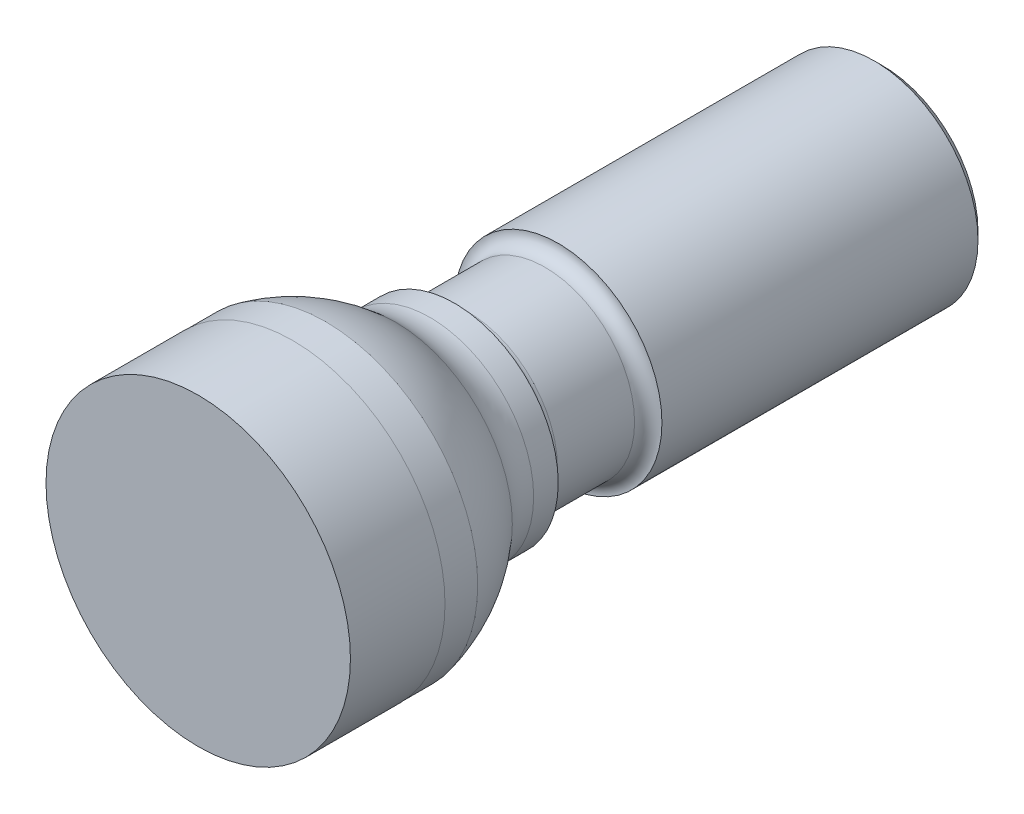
ISO-10303-21;
HEADER;
FILE_DESCRIPTION(('STEP AP214'),'2;1');
FILE_NAME('part.step','',(''),(''),'','','');
FILE_SCHEMA(('AUTOMOTIVE_DESIGN { 1 0 10303 214 1 1 1 1 }'));
ENDSEC;
DATA;
#1=APPLICATION_CONTEXT('core data for automotive mechanical design processes');
#2=APPLICATION_PROTOCOL_DEFINITION('international standard','automotive_design',2000,#1);
#3=PRODUCT_CONTEXT('',#1,'mechanical');
#4=PRODUCT('Part','Part','',(#3));
#5=PRODUCT_RELATED_PRODUCT_CATEGORY('part','',(#4));
#6=PRODUCT_DEFINITION_FORMATION('','',#4);
#7=PRODUCT_DEFINITION_CONTEXT('part definition',#1,'design');
#8=PRODUCT_DEFINITION('design','',#6,#7);
#9=PRODUCT_DEFINITION_SHAPE('','',#8);
#10=(LENGTH_UNIT() NAMED_UNIT(*) SI_UNIT(.MILLI.,.METRE.));
#11=(NAMED_UNIT(*) PLANE_ANGLE_UNIT() SI_UNIT($,.RADIAN.));
#12=(NAMED_UNIT(*) SI_UNIT($,.STERADIAN.) SOLID_ANGLE_UNIT());
#13=UNCERTAINTY_MEASURE_WITH_UNIT(LENGTH_MEASURE(1.E-05),#10,'distance_accuracy_value','');
#14=(GEOMETRIC_REPRESENTATION_CONTEXT(3) GLOBAL_UNCERTAINTY_ASSIGNED_CONTEXT((#13)) GLOBAL_UNIT_ASSIGNED_CONTEXT((#10,
#11,#12)) REPRESENTATION_CONTEXT('',''));
#15=CARTESIAN_POINT('',(0.,0.,0.));
#16=DIRECTION('',(0.,0.,1.));
#17=DIRECTION('',(1.,0.,0.));
#18=AXIS2_PLACEMENT_3D('',#15,#16,#17);
#19=CARTESIAN_POINT('',(0.,3.10340819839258E-13,-5.79120000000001));
#20=DIRECTION('',(0.,0.,1.));
#21=DIRECTION('',(0.,1.,0.));
#22=AXIS2_PLACEMENT_3D('',#19,#20,#21);
#23=SPHERICAL_SURFACE('',#22,9.52499999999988);
#24=CARTESIAN_POINT('',(0.,0.,-7.80770246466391));
#25=DIRECTION('',(0.,0.,1.));
#26=DIRECTION('',(1.,0.,0.));
#27=AXIS2_PLACEMENT_3D('',#24,#25,#26);
#28=CIRCLE('',#27,9.30910000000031);
#29=CARTESIAN_POINT('',(0.,9.30910000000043,-7.80770246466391));
#30=VERTEX_POINT('',#29);
#31=EDGE_CURVE('E192',#30,#30,#28,.T.);
#32=CARTESIAN_POINT('',(0.,0.,-12.0913953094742));
#33=DIRECTION('',(0.,0.,1.));
#34=DIRECTION('',(1.,0.,0.));
#35=AXIS2_PLACEMENT_3D('',#32,#33,#34);
#36=CIRCLE('',#35,7.14374999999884);
#37=CARTESIAN_POINT('',(0.,7.14374999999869,-12.0913953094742));
#38=VERTEX_POINT('',#37);
#39=EDGE_CURVE('E145',#38,#38,#36,.T.);
#40=CARTESIAN_POINT('',(0.,9.30910000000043,-7.80770246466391));
#41=CARTESIAN_POINT('',(0.,9.29839968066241,-7.85710021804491));
#42=CARTESIAN_POINT('',(0.,9.28730610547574,-7.90641278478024));
#43=CARTESIAN_POINT('',(0.,9.26433541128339,-8.00485508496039));
#44=CARTESIAN_POINT('',(0.,9.2524582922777,-8.05398481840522));
#45=CARTESIAN_POINT('',(0.,9.22792347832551,-8.15204899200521));
#46=CARTESIAN_POINT('',(0.,9.21526578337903,-8.20098343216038));
#47=CARTESIAN_POINT('',(0.,9.18917303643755,-8.29864462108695));
#48=CARTESIAN_POINT('',(0.,9.17573798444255,-8.34737136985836));
#49=CARTESIAN_POINT('',(0.,9.14809392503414,-8.44460482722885));
#50=CARTESIAN_POINT('',(0.,9.13388491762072,-8.49311153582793));
#51=CARTESIAN_POINT('',(0.,9.10469654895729,-8.58989262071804));
#52=CARTESIAN_POINT('',(0.,9.08971718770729,-8.63816699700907));
#53=CARTESIAN_POINT('',(0.,9.05899190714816,-8.73447118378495));
#54=CARTESIAN_POINT('',(0.,9.04324598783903,-8.78250099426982));
#55=CARTESIAN_POINT('',(0.,9.01099158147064,-8.8783038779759));
#56=CARTESIAN_POINT('',(0.,8.99448309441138,-8.92607695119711));
#57=CARTESIAN_POINT('',(0.,8.96070773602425,-9.02135425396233));
#58=CARTESIAN_POINT('',(0.,8.94344086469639,-9.06885848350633));
#59=CARTESIAN_POINT('',(0.,8.9081531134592,-9.16358606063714));
#60=CARTESIAN_POINT('',(0.,8.89013223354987,-9.21080940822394));
#61=CARTESIAN_POINT('',(0.,8.85334103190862,-9.30496325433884));
#62=CARTESIAN_POINT('',(0.,8.83457071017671,-9.35189375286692));
#63=CARTESIAN_POINT('',(0.,8.79628538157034,-9.4454500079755));
#64=CARTESIAN_POINT('',(0.,8.77677037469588,-9.49207576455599));
#65=CARTESIAN_POINT('',(0.,8.73700062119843,-9.58501072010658));
#66=CARTESIAN_POINT('',(0.,8.71674587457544,-9.63131991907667));
#67=CARTESIAN_POINT('',(0.,8.6755017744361,-9.72361002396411));
#68=CARTESIAN_POINT('',(0.,8.65451242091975,-9.76959092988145));
#69=CARTESIAN_POINT('',(0.,8.61180442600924,-9.86121279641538));
#70=CARTESIAN_POINT('',(0.,8.59008578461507,-9.90685375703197));
#71=CARTESIAN_POINT('',(0.,8.54592471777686,-9.9977841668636));
#72=CARTESIAN_POINT('',(0.,8.52348229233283,-10.0430736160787));
#73=CARTESIAN_POINT('',(0.,8.47787934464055,-10.1332895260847));
#74=CARTESIAN_POINT('',(0.,8.45471882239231,-10.1782159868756));
#75=CARTESIAN_POINT('',(0.,8.40768555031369,-10.2676945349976));
#76=CARTESIAN_POINT('',(0.,8.38381280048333,-10.3122466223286));
#77=CARTESIAN_POINT('',(0.,8.33536112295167,-10.4009651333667));
#78=CARTESIAN_POINT('',(0.,8.31078219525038,-10.4451315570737));
#79=CARTESIAN_POINT('',(0.,8.2609243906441,-10.5330675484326));
#80=CARTESIAN_POINT('',(0.,8.23564551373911,-10.5768371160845));
#81=CARTESIAN_POINT('',(0.,8.1843942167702,-10.6639683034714));
#82=CARTESIAN_POINT('',(0.,8.15842179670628,-10.7073299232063));
#83=CARTESIAN_POINT('',(0.,8.10578999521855,-10.7936342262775));
#84=CARTESIAN_POINT('',(0.,8.07913061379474,-10.8365769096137));
#85=CARTESIAN_POINT('',(0.,8.02513164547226,-10.9220324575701));
#86=CARTESIAN_POINT('',(0.,7.99779205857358,-10.9645453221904));
#87=CARTESIAN_POINT('',(0.,7.94243960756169,-11.0491304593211));
#88=CARTESIAN_POINT('',(0.,7.91442674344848,-11.0912027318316));
#89=CARTESIAN_POINT('',(0.,7.85773483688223,-11.1748960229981));
#90=CARTESIAN_POINT('',(0.,7.8290557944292,-11.2165170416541));
#91=CARTESIAN_POINT('',(0.,7.77103879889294,-11.2992972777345));
#92=CARTESIAN_POINT('',(0.,7.74170084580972,-11.3404564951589));
#93=CARTESIAN_POINT('',(0.,7.68237346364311,-11.4223026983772));
#94=CARTESIAN_POINT('',(0.,7.65238403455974,-11.4629896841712));
#95=CARTESIAN_POINT('',(0.,7.59176130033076,-11.5438811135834));
#96=CARTESIAN_POINT('',(0.,7.56112799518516,-11.5840855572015));
#97=CARTESIAN_POINT('',(0.,7.49922527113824,-11.6640017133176));
#98=CARTESIAN_POINT('',(0.,7.46795585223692,-11.7037134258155));
#99=CARTESIAN_POINT('',(0.,7.4047888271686,-11.7826340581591));
#100=CARTESIAN_POINT('',(0.,7.3728912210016,-11.8218429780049));
#101=CARTESIAN_POINT('',(0.,7.30847589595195,-11.899748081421));
#102=CARTESIAN_POINT('',(0.,7.2759581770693,-11.9384442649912));
#103=CARTESIAN_POINT('',(0.,7.21031089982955,-12.0153141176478));
#104=CARTESIAN_POINT('',(0.,7.17718134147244,-12.0534877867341));
#105=CARTESIAN_POINT('',(0.,7.14374999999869,-12.0913953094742));
#106=B_SPLINE_CURVE_WITH_KNOTS('',3,(#40,#41,#42,#43,#44,#45,#46,#47,#48,#49,#50,#51,#52,#53,
#54,#55,#56,#57,#58,#59,#60,#61,#62,#63,#64,#65,#66,#67,#68,#69,#70,#71,#72,#73,#74,#75,#76,#77,
#78,#79,#80,#81,#82,#83,#84,#85,#86,#87,#88,#89,#90,#91,#92,#93,#94,#95,#96,#97,#98,#99,#100,
#101,#102,#103,#104,#105),.UNSPECIFIED.,.F.,.F.,(4,2,2,2,2,2,2,2,2,2,2,2,2,2,2,2,2,2,2,2,2,2,2,
2,2,2,2,2,2,2,2,2,4),(0.,0.15162858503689,0.30325717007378,0.454885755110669,0.60651434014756,
0.758142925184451,0.909771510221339,1.06140009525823,1.21302868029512,1.36465726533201,
1.5162858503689,1.66791443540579,1.81954302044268,1.97117160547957,2.12280019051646,
2.27442877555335,2.42605736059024,2.57768594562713,2.72931453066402,2.88094311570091,
3.0325717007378,3.18420028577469,3.33582887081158,3.48745745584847,3.63908604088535,
3.79071462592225,3.94234321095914,4.09397179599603,4.24560038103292,4.39722896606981,
4.5488575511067,4.70048613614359,4.85211472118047),.UNSPECIFIED.);
#107=EDGE_CURVE('BSEAM33',#30,#38,#106,.T.);
#108=ORIENTED_EDGE('',*,*,#31,.F.);
#109=ORIENTED_EDGE('',*,*,#39,.T.);
#110=ORIENTED_EDGE('',*,*,#107,.T.);
#111=ORIENTED_EDGE('',*,*,#107,.F.);
#112=EDGE_LOOP('',(#108,#110,#109,#111));
#113=FACE_BOUND('',#112,.T.);
#114=ADVANCED_FACE('F33',(#113),#23,.T.);
#115=CARTESIAN_POINT('',(0.,0.,0.));
#116=DIRECTION('',(0.,0.,1.));
#117=DIRECTION('',(1.,0.,0.));
#118=AXIS2_PLACEMENT_3D('',#115,#116,#117);
#119=CYLINDRICAL_SURFACE('',#118,9.30910000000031);
#120=CARTESIAN_POINT('',(0.,0.,-5.7912));
#121=DIRECTION('',(0.,0.,1.));
#122=DIRECTION('',(1.,0.,0.));
#123=AXIS2_PLACEMENT_3D('',#120,#121,#122);
#124=CIRCLE('',#123,9.30910000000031);
#125=CARTESIAN_POINT('',(9.30910000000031,0.,-5.7912));
#126=VERTEX_POINT('',#125);
#127=EDGE_CURVE('E189',#126,#126,#124,.T.);
#128=ORIENTED_EDGE('',*,*,#127,.F.);
#129=EDGE_LOOP('',(#128));
#130=FACE_BOUND('',#129,.T.);
#131=ORIENTED_EDGE('',*,*,#31,.T.);
#132=EDGE_LOOP('',(#131));
#133=FACE_BOUND('',#132,.T.);
#134=ADVANCED_FACE('F256',(#130,#133),#119,.T.);
#135=CARTESIAN_POINT('',(0.,9.30910000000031,-5.7912));
#136=DIRECTION('',(0.,0.,1.));
#137=DIRECTION('',(1.,0.,0.));
#138=AXIS2_PLACEMENT_3D('',#135,#136,#137);
#139=PLANE('',#138);
#140=CARTESIAN_POINT('',(0.,0.,-5.7912));
#141=DIRECTION('',(0.,0.,1.));
#142=DIRECTION('',(1.,0.,0.));
#143=AXIS2_PLACEMENT_3D('',#140,#141,#142);
#144=CIRCLE('',#143,9.32180000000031);
#145=CARTESIAN_POINT('',(9.32180000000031,0.,-5.7912));
#146=VERTEX_POINT('',#145);
#147=EDGE_CURVE('E186',#146,#146,#144,.T.);
#148=ORIENTED_EDGE('',*,*,#147,.F.);
#149=EDGE_LOOP('',(#148));
#150=FACE_BOUND('',#149,.T.);
#151=ORIENTED_EDGE('',*,*,#127,.T.);
#152=EDGE_LOOP('',(#151));
#153=FACE_BOUND('',#152,.T.);
#154=ADVANCED_FACE('F261',(#150,#153),#139,.F.);
#155=CARTESIAN_POINT('',(0.,0.,0.));
#156=DIRECTION('',(0.,0.,1.));
#157=DIRECTION('',(1.,0.,0.));
#158=AXIS2_PLACEMENT_3D('',#155,#156,#157);
#159=CYLINDRICAL_SURFACE('',#158,9.32180000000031);
#160=CARTESIAN_POINT('',(0.,0.,0.));
#161=DIRECTION('',(0.,0.,1.));
#162=DIRECTION('',(1.,0.,0.));
#163=AXIS2_PLACEMENT_3D('',#160,#161,#162);
#164=CIRCLE('',#163,9.32180000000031);
#165=CARTESIAN_POINT('',(9.32180000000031,0.,0.));
#166=VERTEX_POINT('',#165);
#167=EDGE_CURVE('E183',#166,#166,#164,.T.);
#168=ORIENTED_EDGE('',*,*,#167,.F.);
#169=EDGE_LOOP('',(#168));
#170=FACE_BOUND('',#169,.T.);
#171=ORIENTED_EDGE('',*,*,#147,.T.);
#172=EDGE_LOOP('',(#171));
#173=FACE_BOUND('',#172,.T.);
#174=ADVANCED_FACE('F315',(#170,#173),#159,.T.);
#175=CARTESIAN_POINT('',(0.,9.32180000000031,0.));
#176=DIRECTION('',(0.,0.,-1.));
#177=DIRECTION('',(-1.,0.,0.));
#178=AXIS2_PLACEMENT_3D('',#175,#176,#177);
#179=PLANE('',#178);
#180=ORIENTED_EDGE('',*,*,#167,.T.);
#181=EDGE_LOOP('',(#180));
#182=FACE_BOUND('',#181,.T.);
#183=ADVANCED_FACE('F310',(#182),#179,.F.);
#184=CARTESIAN_POINT('',(0.,3.17499999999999,-41.9100000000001));
#185=DIRECTION('',(0.,0.,1.));
#186=DIRECTION('',(1.,0.,0.));
#187=AXIS2_PLACEMENT_3D('',#184,#185,#186);
#188=PLANE('',#187);
#189=CARTESIAN_POINT('',(0.,0.,-41.9100000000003));
#190=DIRECTION('',(0.,0.,1.));
#191=DIRECTION('',(1.,0.,0.));
#192=AXIS2_PLACEMENT_3D('',#189,#190,#191);
#193=CIRCLE('',#192,5.84197845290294);
#194=CARTESIAN_POINT('',(5.84197845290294,0.,-41.9100000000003));
#195=VERTEX_POINT('',#194);
#196=EDGE_CURVE('E177',#195,#195,#193,.T.);
#197=ORIENTED_EDGE('',*,*,#196,.F.);
#198=EDGE_LOOP('',(#197));
#199=FACE_BOUND('',#198,.T.);
#200=DIRECTION('',(-0.5,-0.866025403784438,0.));
#201=VECTOR('',#200,1.);
#202=CARTESIAN_POINT('',(-1.3748153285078,3.96875,-41.9100000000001));
#203=LINE('',#202,#201);
#204=CARTESIAN_POINT('',(-1.83308710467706,3.175,-41.9100000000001));
#205=VERTEX_POINT('',#204);
#206=CARTESIAN_POINT('',(-3.66617420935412,0.,-41.9100000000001));
#207=VERTEX_POINT('',#206);
#208=EDGE_CURVE('E56',#205,#207,#203,.T.);
#209=ORIENTED_EDGE('',*,*,#208,.T.);
#210=DIRECTION('',(0.5,-0.866025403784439,0.));
#211=VECTOR('',#210,1.);
#212=CARTESIAN_POINT('',(-4.12444598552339,0.793749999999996,-41.9100000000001));
#213=LINE('',#212,#211);
#214=CARTESIAN_POINT('',(-1.83308710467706,-3.175,-41.9100000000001));
#215=VERTEX_POINT('',#214);
#216=EDGE_CURVE('E117',#207,#215,#213,.T.);
#217=ORIENTED_EDGE('',*,*,#216,.T.);
#218=DIRECTION('',(1.,0.,0.));
#219=VECTOR('',#218,1.);
#220=CARTESIAN_POINT('',(0.,-3.175,-41.9100000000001));
#221=LINE('',#220,#219);
#222=CARTESIAN_POINT('',(1.83308710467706,-3.175,-41.9100000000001));
#223=VERTEX_POINT('',#222);
#224=EDGE_CURVE('E202',#215,#223,#221,.T.);
#225=ORIENTED_EDGE('',*,*,#224,.T.);
#226=DIRECTION('',(0.5,0.866025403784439,0.));
#227=VECTOR('',#226,1.);
#228=CARTESIAN_POINT('',(4.12444598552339,0.793749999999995,-41.9100000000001));
#229=LINE('',#228,#227);
#230=CARTESIAN_POINT('',(3.66617420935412,0.,-41.9100000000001));
#231=VERTEX_POINT('',#230);
#232=EDGE_CURVE('E200',#223,#231,#229,.T.);
#233=ORIENTED_EDGE('',*,*,#232,.T.);
#234=DIRECTION('',(-0.5,0.866025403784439,0.));
#235=VECTOR('',#234,1.);
#236=CARTESIAN_POINT('',(1.3748153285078,3.96875,-41.9100000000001));
#237=LINE('',#236,#235);
#238=CARTESIAN_POINT('',(1.83308710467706,3.175,-41.9100000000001));
#239=VERTEX_POINT('',#238);
#240=EDGE_CURVE('E198',#231,#239,#237,.T.);
#241=ORIENTED_EDGE('',*,*,#240,.T.);
#242=DIRECTION('',(-1.,0.,0.));
#243=VECTOR('',#242,1.);
#244=CARTESIAN_POINT('',(0.,3.175,-41.9100000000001));
#245=LINE('',#244,#243);
#246=EDGE_CURVE('E196',#239,#205,#245,.T.);
#247=ORIENTED_EDGE('',*,*,#246,.T.);
#248=EDGE_LOOP('',(#209,#217,#225,#233,#241,#247));
#249=FACE_BOUND('',#248,.T.);
#250=ADVANCED_FACE('F236',(#199,#249),#188,.F.);
#251=CARTESIAN_POINT('',(0.,0.,-41.9100000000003));
#252=DIRECTION('',(0.,0.,1.));
#253=DIRECTION('',(1.,0.,0.));
#254=AXIS2_PLACEMENT_3D('',#251,#252,#253);
#255=CONICAL_SURFACE('',#254,5.84197845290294,0.785396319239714);
#256=CARTESIAN_POINT('',(0.,0.,-41.4019765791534));
#257=DIRECTION('',(0.,0.,1.));
#258=DIRECTION('',(1.,0.,0.));
#259=AXIS2_PLACEMENT_3D('',#256,#257,#258);
#260=CIRCLE('',#259,6.3500000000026);
#261=CARTESIAN_POINT('',(6.3500000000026,0.,-41.4019765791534));
#262=VERTEX_POINT('',#261);
#263=EDGE_CURVE('E174',#262,#262,#260,.T.);
#264=ORIENTED_EDGE('',*,*,#263,.F.);
#265=EDGE_LOOP('',(#264));
#266=FACE_BOUND('',#265,.T.);
#267=ORIENTED_EDGE('',*,*,#196,.T.);
#268=EDGE_LOOP('',(#267));
#269=FACE_BOUND('',#268,.T.);
#270=ADVANCED_FACE('F300',(#266,#269),#255,.T.);
#271=CARTESIAN_POINT('',(0.,0.,0.));
#272=DIRECTION('',(0.,0.,1.));
#273=DIRECTION('',(1.,0.,0.));
#274=AXIS2_PLACEMENT_3D('',#271,#272,#273);
#275=CYLINDRICAL_SURFACE('',#274,6.35000000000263);
#276=CARTESIAN_POINT('',(0.,0.,-22.0471999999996));
#277=DIRECTION('',(0.,0.,1.));
#278=DIRECTION('',(1.,0.,0.));
#279=AXIS2_PLACEMENT_3D('',#276,#277,#278);
#280=CIRCLE('',#279,6.35000000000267);
#281=CARTESIAN_POINT('',(6.35000000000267,0.,-22.0471999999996));
#282=VERTEX_POINT('',#281);
#283=EDGE_CURVE('E171',#282,#282,#280,.T.);
#284=ORIENTED_EDGE('',*,*,#283,.F.);
#285=EDGE_LOOP('',(#284));
#286=FACE_BOUND('',#285,.T.);
#287=ORIENTED_EDGE('',*,*,#263,.T.);
#288=EDGE_LOOP('',(#287));
#289=FACE_BOUND('',#288,.T.);
#290=ADVANCED_FACE('F294',(#286,#289),#275,.T.);
#291=CARTESIAN_POINT('',(0.,0.,-21.2359890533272));
#292=DIRECTION('',(0.,0.,1.));
#293=DIRECTION('',(1.,0.,0.));
#294=AXIS2_PLACEMENT_3D('',#291,#292,#293);
#295=TOROIDAL_SURFACE('',#294,6.29920000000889,0.812800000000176);
#296=CARTESIAN_POINT('',(0.,0.,-21.235989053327));
#297=DIRECTION('',(0.,0.,1.));
#298=DIRECTION('',(1.,0.,0.));
#299=AXIS2_PLACEMENT_3D('',#296,#297,#298);
#300=CIRCLE('',#299,5.48640000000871);
#301=CARTESIAN_POINT('',(5.48640000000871,0.,-21.235989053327));
#302=VERTEX_POINT('',#301);
#303=EDGE_CURVE('E168',#302,#302,#300,.T.);
#304=ORIENTED_EDGE('',*,*,#303,.F.);
#305=EDGE_LOOP('',(#304));
#306=FACE_BOUND('',#305,.T.);
#307=ORIENTED_EDGE('',*,*,#283,.T.);
#308=EDGE_LOOP('',(#307));
#309=FACE_BOUND('',#308,.T.);
#310=ADVANCED_FACE('F288',(#306,#309),#295,.F.);
#311=CARTESIAN_POINT('',(0.,0.,0.));
#312=DIRECTION('',(0.,0.,1.));
#313=DIRECTION('',(1.,0.,0.));
#314=AXIS2_PLACEMENT_3D('',#311,#312,#313);
#315=CYLINDRICAL_SURFACE('',#314,5.48640000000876);
#316=CARTESIAN_POINT('',(0.,0.,-16.5084109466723));
#317=DIRECTION('',(0.,0.,1.));
#318=DIRECTION('',(1.,0.,0.));
#319=AXIS2_PLACEMENT_3D('',#316,#317,#318);
#320=CIRCLE('',#319,5.4864000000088);
#321=CARTESIAN_POINT('',(5.4864000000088,0.,-16.5084109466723));
#322=VERTEX_POINT('',#321);
#323=EDGE_CURVE('E165',#322,#322,#320,.T.);
#324=ORIENTED_EDGE('',*,*,#323,.F.);
#325=EDGE_LOOP('',(#324));
#326=FACE_BOUND('',#325,.T.);
#327=ORIENTED_EDGE('',*,*,#303,.T.);
#328=EDGE_LOOP('',(#327));
#329=FACE_BOUND('',#328,.T.);
#330=ADVANCED_FACE('F282',(#326,#329),#315,.T.);
#331=CARTESIAN_POINT('',(0.,0.,-16.5084109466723));
#332=DIRECTION('',(0.,0.,1.));
#333=DIRECTION('',(1.,0.,0.));
#334=AXIS2_PLACEMENT_3D('',#331,#332,#333);
#335=TOROIDAL_SURFACE('',#334,6.29920000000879,0.812799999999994);
#336=CARTESIAN_POINT('',(0.,0.,-15.6972));
#337=DIRECTION('',(0.,0.,1.));
#338=DIRECTION('',(1.,0.,0.));
#339=AXIS2_PLACEMENT_3D('',#336,#337,#338);
#340=CIRCLE('',#339,6.34999999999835);
#341=CARTESIAN_POINT('',(6.34999999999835,0.,-15.6972));
#342=VERTEX_POINT('',#341);
#343=EDGE_CURVE('E162',#342,#342,#340,.T.);
#344=ORIENTED_EDGE('',*,*,#343,.F.);
#345=EDGE_LOOP('',(#344));
#346=FACE_BOUND('',#345,.T.);
#347=ORIENTED_EDGE('',*,*,#323,.T.);
#348=EDGE_LOOP('',(#347));
#349=FACE_BOUND('',#348,.T.);
#350=ADVANCED_FACE('F276',(#346,#349),#335,.F.);
#351=CARTESIAN_POINT('',(0.,0.,0.));
#352=DIRECTION('',(0.,0.,1.));
#353=DIRECTION('',(1.,0.,0.));
#354=AXIS2_PLACEMENT_3D('',#351,#352,#353);
#355=CYLINDRICAL_SURFACE('',#354,6.34999999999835);
#356=CARTESIAN_POINT('',(0.,0.,-14.1914604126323));
#357=DIRECTION('',(0.,0.,1.));
#358=DIRECTION('',(1.,0.,0.));
#359=AXIS2_PLACEMENT_3D('',#356,#357,#358);
#360=CIRCLE('',#359,6.34999999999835);
#361=CARTESIAN_POINT('',(6.34999999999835,0.,-14.1914604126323));
#362=VERTEX_POINT('',#361);
#363=EDGE_CURVE('E159',#362,#362,#360,.T.);
#364=ORIENTED_EDGE('',*,*,#363,.F.);
#365=EDGE_LOOP('',(#364));
#366=FACE_BOUND('',#365,.T.);
#367=ORIENTED_EDGE('',*,*,#343,.T.);
#368=EDGE_LOOP('',(#367));
#369=FACE_BOUND('',#368,.T.);
#370=ADVANCED_FACE('F270',(#366,#369),#355,.T.);
#371=CARTESIAN_POINT('',(0.,0.,-14.1914604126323));
#372=DIRECTION('',(0.,0.,1.));
#373=DIRECTION('',(1.,0.,0.));
#374=AXIS2_PLACEMENT_3D('',#371,#372,#373);
#375=TOROIDAL_SURFACE('',#374,9.52499999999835,3.175);
#376=ORIENTED_EDGE('',*,*,#39,.F.);
#377=EDGE_LOOP('',(#376));
#378=FACE_BOUND('',#377,.T.);
#379=ORIENTED_EDGE('',*,*,#363,.T.);
#380=EDGE_LOOP('',(#379));
#381=FACE_BOUND('',#380,.T.);
#382=ADVANCED_FACE('F267',(#378,#381),#375,.F.);
#383=CARTESIAN_POINT('',(-3.66617420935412,0.,-35.5600000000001));
#384=DIRECTION('',(0.,0.,-1.));
#385=DIRECTION('',(-1.,0.,0.));
#386=AXIS2_PLACEMENT_3D('',#383,#384,#385);
#387=PLANE('',#386);
#388=CARTESIAN_POINT('',(0.,0.,-35.5600000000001));
#389=DIRECTION('',(0.,0.,-1.));
#390=DIRECTION('',(-1.,0.,0.));
#391=AXIS2_PLACEMENT_3D('',#388,#389,#390);
#392=CIRCLE('',#391,3.17500000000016);
#393=CARTESIAN_POINT('',(-2.74963065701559,-1.5875,-35.5600000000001));
#394=VERTEX_POINT('',#393);
#395=CARTESIAN_POINT('',(0.,-3.175,-35.5600000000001));
#396=VERTEX_POINT('',#395);
#397=EDGE_CURVE('E11',#394,#396,#392,.F.);
#398=ORIENTED_EDGE('',*,*,#397,.T.);
#399=DIRECTION('',(-1.,0.,0.));
#400=VECTOR('',#399,1.);
#401=CARTESIAN_POINT('',(1.83308710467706,-3.175,-35.5600000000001));
#402=LINE('',#401,#400);
#403=CARTESIAN_POINT('',(-1.83308710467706,-3.175,-35.5600000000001));
#404=VERTEX_POINT('',#403);
#405=EDGE_CURVE('E140',#396,#404,#402,.T.);
#406=ORIENTED_EDGE('',*,*,#405,.T.);
#407=DIRECTION('',(-0.5,0.866025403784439,0.));
#408=VECTOR('',#407,1.);
#409=CARTESIAN_POINT('',(-1.83308710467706,-3.175,-35.5600000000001));
#410=LINE('',#409,#408);
#411=EDGE_CURVE('E111',#404,#394,#410,.T.);
#412=ORIENTED_EDGE('',*,*,#411,.T.);
#413=EDGE_LOOP('',(#398,#406,#412));
#414=FACE_BOUND('',#413,.T.);
#415=ADVANCED_FACE('F232',(#414),#387,.T.);
#416=CARTESIAN_POINT('',(2.74963065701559,-1.5875,-35.5600000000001));
#417=VERTEX_POINT('',#416);
#418=EDGE_CURVE('E41',#396,#417,#392,.F.);
#419=ORIENTED_EDGE('',*,*,#418,.T.);
#420=DIRECTION('',(-0.5,-0.866025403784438,0.));
#421=VECTOR('',#420,1.);
#422=CARTESIAN_POINT('',(3.66617420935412,0.,-35.5600000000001));
#423=LINE('',#422,#421);
#424=CARTESIAN_POINT('',(1.83308710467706,-3.175,-35.5600000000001));
#425=VERTEX_POINT('',#424);
#426=EDGE_CURVE('E136',#417,#425,#423,.T.);
#427=ORIENTED_EDGE('',*,*,#426,.T.);
#428=EDGE_CURVE('E120',#425,#396,#402,.T.);
#429=ORIENTED_EDGE('',*,*,#428,.T.);
#430=EDGE_LOOP('',(#419,#427,#429));
#431=FACE_BOUND('',#430,.T.);
#432=ADVANCED_FACE('F218',(#431),#387,.T.);
#433=CARTESIAN_POINT('',(2.74963065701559,1.5875,-35.5600000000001));
#434=VERTEX_POINT('',#433);
#435=EDGE_CURVE('E208',#417,#434,#392,.F.);
#436=ORIENTED_EDGE('',*,*,#435,.T.);
#437=DIRECTION('',(0.5,-0.866025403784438,0.));
#438=VECTOR('',#437,1.);
#439=CARTESIAN_POINT('',(1.83308710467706,3.175,-35.5600000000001));
#440=LINE('',#439,#438);
#441=CARTESIAN_POINT('',(3.66617420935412,0.,-35.5600000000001));
#442=VERTEX_POINT('',#441);
#443=EDGE_CURVE('E132',#434,#442,#440,.T.);
#444=ORIENTED_EDGE('',*,*,#443,.T.);
#445=EDGE_CURVE('E137',#442,#417,#423,.T.);
#446=ORIENTED_EDGE('',*,*,#445,.T.);
#447=EDGE_LOOP('',(#436,#444,#446));
#448=FACE_BOUND('',#447,.T.);
#449=ADVANCED_FACE('F227',(#448),#387,.T.);
#450=CARTESIAN_POINT('',(0.,3.175,-35.5600000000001));
#451=VERTEX_POINT('',#450);
#452=EDGE_CURVE('E205',#434,#451,#392,.F.);
#453=ORIENTED_EDGE('',*,*,#452,.T.);
#454=DIRECTION('',(1.,0.,0.));
#455=VECTOR('',#454,1.);
#456=CARTESIAN_POINT('',(-1.83308710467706,3.175,-35.5600000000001));
#457=LINE('',#456,#455);
#458=CARTESIAN_POINT('',(1.83308710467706,3.175,-35.5600000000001));
#459=VERTEX_POINT('',#458);
#460=EDGE_CURVE('E126',#451,#459,#457,.T.);
#461=ORIENTED_EDGE('',*,*,#460,.T.);
#462=EDGE_CURVE('E133',#459,#434,#440,.T.);
#463=ORIENTED_EDGE('',*,*,#462,.T.);
#464=EDGE_LOOP('',(#453,#461,#463));
#465=FACE_BOUND('',#464,.T.);
#466=ADVANCED_FACE('F248',(#465),#387,.T.);
#467=CARTESIAN_POINT('',(-2.74963065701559,1.5875,-35.5600000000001));
#468=VERTEX_POINT('',#467);
#469=EDGE_CURVE('E204',#451,#468,#392,.F.);
#470=ORIENTED_EDGE('',*,*,#469,.T.);
#471=DIRECTION('',(0.5,0.866025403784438,0.));
#472=VECTOR('',#471,1.);
#473=CARTESIAN_POINT('',(-3.66617420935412,0.,-35.5600000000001));
#474=LINE('',#473,#472);
#475=CARTESIAN_POINT('',(-1.83308710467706,3.175,-35.5600000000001));
#476=VERTEX_POINT('',#475);
#477=EDGE_CURVE('E124',#468,#476,#474,.T.);
#478=ORIENTED_EDGE('',*,*,#477,.T.);
#479=EDGE_CURVE('E128',#476,#451,#457,.T.);
#480=ORIENTED_EDGE('',*,*,#479,.T.);
#481=EDGE_LOOP('',(#470,#478,#480));
#482=FACE_BOUND('',#481,.T.);
#483=ADVANCED_FACE('F246',(#482),#387,.T.);
#484=EDGE_CURVE('E36',#468,#394,#392,.F.);
#485=ORIENTED_EDGE('',*,*,#484,.T.);
#486=CARTESIAN_POINT('',(-3.66617420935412,0.,-35.5600000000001));
#487=VERTEX_POINT('',#486);
#488=EDGE_CURVE('E104',#394,#487,#410,.T.);
#489=ORIENTED_EDGE('',*,*,#488,.T.);
#490=EDGE_CURVE('E48',#487,#468,#474,.T.);
#491=ORIENTED_EDGE('',*,*,#490,.T.);
#492=EDGE_LOOP('',(#485,#489,#491));
#493=FACE_BOUND('',#492,.T.);
#494=ADVANCED_FACE('F106',(#493),#387,.T.);
#495=CARTESIAN_POINT('',(-1.83308710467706,-3.175,-35.5600000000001));
#496=DIRECTION('',(-0.866025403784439,-0.5,0.));
#497=DIRECTION('',(0.5,-0.866025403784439,0.));
#498=AXIS2_PLACEMENT_3D('',#495,#496,#497);
#499=PLANE('',#498);
#500=ORIENTED_EDGE('',*,*,#411,.F.);
#501=DIRECTION('',(0.,0.,-1.));
#502=VECTOR('',#501,1.);
#503=CARTESIAN_POINT('',(-1.83308710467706,-3.175,-35.5600000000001));
#504=LINE('',#503,#502);
#505=EDGE_CURVE('E143',#404,#215,#504,.T.);
#506=ORIENTED_EDGE('',*,*,#505,.T.);
#507=ORIENTED_EDGE('',*,*,#216,.F.);
#508=DIRECTION('',(0.,0.,-1.));
#509=VECTOR('',#508,1.);
#510=CARTESIAN_POINT('',(-3.66617420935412,0.,-35.5600000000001));
#511=LINE('',#510,#509);
#512=EDGE_CURVE('E114',#487,#207,#511,.T.);
#513=ORIENTED_EDGE('',*,*,#512,.F.);
#514=ORIENTED_EDGE('',*,*,#488,.F.);
#515=EDGE_LOOP('',(#500,#506,#507,#513,#514));
#516=FACE_BOUND('',#515,.T.);
#517=ADVANCED_FACE('F115',(#516),#499,.F.);
#518=CARTESIAN_POINT('',(1.83308710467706,-3.175,-35.5600000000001));
#519=DIRECTION('',(0.,-1.,0.));
#520=DIRECTION('',(1.,0.,0.));
#521=AXIS2_PLACEMENT_3D('',#518,#519,#520);
#522=PLANE('',#521);
#523=ORIENTED_EDGE('',*,*,#428,.F.);
#524=DIRECTION('',(0.,0.,-1.));
#525=VECTOR('',#524,1.);
#526=CARTESIAN_POINT('',(1.83308710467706,-3.175,-35.5600000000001));
#527=LINE('',#526,#525);
#528=EDGE_CURVE('E146',#425,#223,#527,.T.);
#529=ORIENTED_EDGE('',*,*,#528,.T.);
#530=ORIENTED_EDGE('',*,*,#224,.F.);
#531=ORIENTED_EDGE('',*,*,#505,.F.);
#532=ORIENTED_EDGE('',*,*,#405,.F.);
#533=EDGE_LOOP('',(#523,#529,#530,#531,#532));
#534=FACE_BOUND('',#533,.T.);
#535=ADVANCED_FACE('F235',(#534),#522,.F.);
#536=CARTESIAN_POINT('',(3.66617420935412,0.,-35.5600000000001));
#537=DIRECTION('',(0.866025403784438,-0.5,0.));
#538=DIRECTION('',(0.5,0.866025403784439,0.));
#539=AXIS2_PLACEMENT_3D('',#536,#537,#538);
#540=PLANE('',#539);
#541=ORIENTED_EDGE('',*,*,#445,.F.);
#542=DIRECTION('',(0.,0.,-1.));
#543=VECTOR('',#542,1.);
#544=CARTESIAN_POINT('',(3.66617420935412,0.,-35.5600000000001));
#545=LINE('',#544,#543);
#546=EDGE_CURVE('E149',#442,#231,#545,.T.);
#547=ORIENTED_EDGE('',*,*,#546,.T.);
#548=ORIENTED_EDGE('',*,*,#232,.F.);
#549=ORIENTED_EDGE('',*,*,#528,.F.);
#550=ORIENTED_EDGE('',*,*,#426,.F.);
#551=EDGE_LOOP('',(#541,#547,#548,#549,#550));
#552=FACE_BOUND('',#551,.T.);
#553=ADVANCED_FACE('F225',(#552),#540,.F.);
#554=CARTESIAN_POINT('',(1.83308710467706,3.175,-35.5600000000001));
#555=DIRECTION('',(0.866025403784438,0.5,0.));
#556=DIRECTION('',(-0.5,0.866025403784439,0.));
#557=AXIS2_PLACEMENT_3D('',#554,#555,#556);
#558=PLANE('',#557);
#559=ORIENTED_EDGE('',*,*,#462,.F.);
#560=DIRECTION('',(0.,0.,-1.));
#561=VECTOR('',#560,1.);
#562=CARTESIAN_POINT('',(1.83308710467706,3.175,-35.5600000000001));
#563=LINE('',#562,#561);
#564=EDGE_CURVE('E152',#459,#239,#563,.T.);
#565=ORIENTED_EDGE('',*,*,#564,.T.);
#566=ORIENTED_EDGE('',*,*,#240,.F.);
#567=ORIENTED_EDGE('',*,*,#546,.F.);
#568=ORIENTED_EDGE('',*,*,#443,.F.);
#569=EDGE_LOOP('',(#559,#565,#566,#567,#568));
#570=FACE_BOUND('',#569,.T.);
#571=ADVANCED_FACE('F240',(#570),#558,.F.);
#572=CARTESIAN_POINT('',(-1.83308710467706,3.175,-35.5600000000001));
#573=DIRECTION('',(0.,1.,0.));
#574=DIRECTION('',(0.,0.,1.));
#575=AXIS2_PLACEMENT_3D('',#572,#573,#574);
#576=PLANE('',#575);
#577=ORIENTED_EDGE('',*,*,#479,.F.);
#578=DIRECTION('',(0.,0.,-1.));
#579=VECTOR('',#578,1.);
#580=CARTESIAN_POINT('',(-1.83308710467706,3.175,-35.5600000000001));
#581=LINE('',#580,#579);
#582=EDGE_CURVE('E119',#476,#205,#581,.T.);
#583=ORIENTED_EDGE('',*,*,#582,.T.);
#584=ORIENTED_EDGE('',*,*,#246,.F.);
#585=ORIENTED_EDGE('',*,*,#564,.F.);
#586=ORIENTED_EDGE('',*,*,#460,.F.);
#587=EDGE_LOOP('',(#577,#583,#584,#585,#586));
#588=FACE_BOUND('',#587,.T.);
#589=ADVANCED_FACE('F245',(#588),#576,.F.);
#590=CARTESIAN_POINT('',(-3.66617420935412,0.,-35.5600000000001));
#591=DIRECTION('',(-0.866025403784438,0.5,0.));
#592=DIRECTION('',(-0.5,-0.866025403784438,0.));
#593=AXIS2_PLACEMENT_3D('',#590,#591,#592);
#594=PLANE('',#593);
#595=ORIENTED_EDGE('',*,*,#490,.F.);
#596=ORIENTED_EDGE('',*,*,#512,.T.);
#597=ORIENTED_EDGE('',*,*,#208,.F.);
#598=ORIENTED_EDGE('',*,*,#582,.F.);
#599=ORIENTED_EDGE('',*,*,#477,.F.);
#600=EDGE_LOOP('',(#595,#596,#597,#598,#599));
#601=FACE_BOUND('',#600,.T.);
#602=ADVANCED_FACE('F122',(#601),#594,.F.);
#603=CARTESIAN_POINT('',(0.,0.,-30.6042675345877));
#604=DIRECTION('',(0.,0.,-1.));
#605=DIRECTION('',(-1.,0.,0.));
#606=AXIS2_PLACEMENT_3D('',#603,#604,#605);
#607=CONICAL_SURFACE('',#606,0.,1.02974425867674);
#608=CARTESIAN_POINT('',(0.,0.,-32.512));
#609=DIRECTION('',(0.,0.,1.));
#610=DIRECTION('',(1.,0.,0.));
#611=AXIS2_PLACEMENT_3D('',#608,#609,#610);
#612=CIRCLE('',#611,3.17500000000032);
#613=CARTESIAN_POINT('',(3.17500000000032,0.,-32.512));
#614=VERTEX_POINT('',#613);
#615=EDGE_CURVE('E180',#614,#614,#612,.T.);
#616=ORIENTED_EDGE('',*,*,#615,.F.);
#617=EDGE_LOOP('',(#616));
#618=FACE_BOUND('',#617,.T.);
#619=CARTESIAN_POINT('',(0.,0.,-30.6042675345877));
#620=VERTEX_POINT('',#619);
#621=VERTEX_LOOP('',#620);
#622=FACE_BOUND('',#621,.T.);
#623=ADVANCED_FACE('F321',(#618,#622),#607,.F.);
#624=CARTESIAN_POINT('',(0.,0.,0.));
#625=DIRECTION('',(0.,0.,1.));
#626=DIRECTION('',(1.,0.,0.));
#627=AXIS2_PLACEMENT_3D('',#624,#625,#626);
#628=CYLINDRICAL_SURFACE('',#627,3.17500000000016);
#629=ORIENTED_EDGE('',*,*,#615,.T.);
#630=EDGE_LOOP('',(#629));
#631=FACE_BOUND('',#630,.T.);
#632=ORIENTED_EDGE('',*,*,#397,.F.);
#633=ORIENTED_EDGE('',*,*,#484,.F.);
#634=ORIENTED_EDGE('',*,*,#469,.F.);
#635=ORIENTED_EDGE('',*,*,#452,.F.);
#636=ORIENTED_EDGE('',*,*,#435,.F.);
#637=ORIENTED_EDGE('',*,*,#418,.F.);
#638=EDGE_LOOP('',(#632,#633,#634,#635,#636,#637));
#639=FACE_BOUND('',#638,.T.);
#640=ADVANCED_FACE('F229',(#631,#639),#628,.F.);
#641=CLOSED_SHELL('',(#114,#134,#154,#174,#183,#250,#270,#290,#310,#330,#350,#370,#382,#415,
#432,#449,#466,#483,#494,#517,#535,#553,#571,#589,#602,#623,#640));
#642=MANIFOLD_SOLID_BREP('B2',#641);
#643=ADVANCED_BREP_SHAPE_REPRESENTATION('',(#18,#642),#14);
#644=SHAPE_DEFINITION_REPRESENTATION(#9,#643);
ENDSEC;
END-ISO-10303-21;
